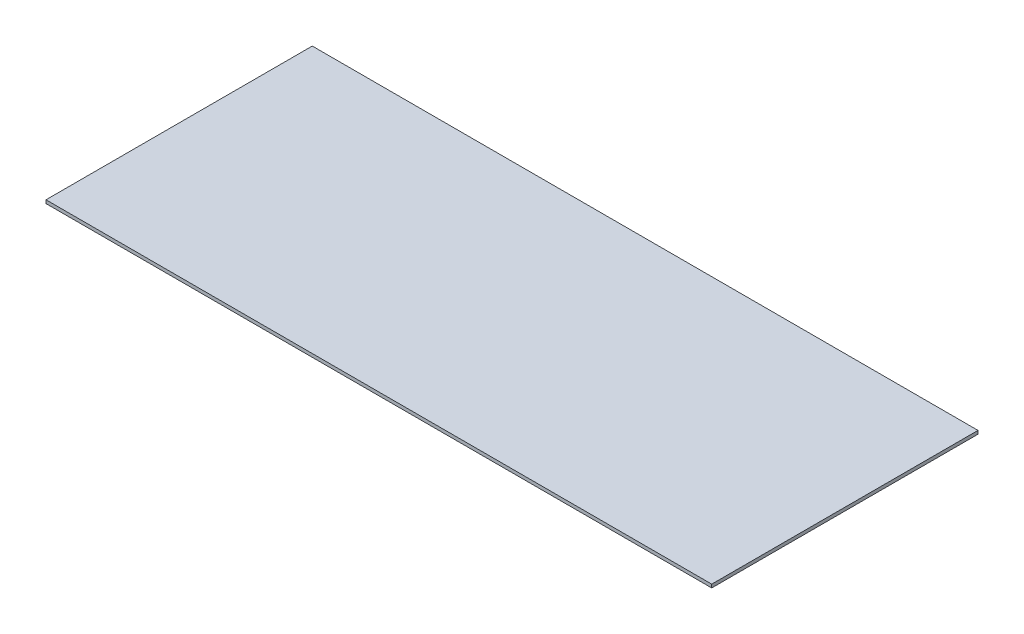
ISO-10303-21;
HEADER;
FILE_DESCRIPTION(('STEP AP214'),'2;1');
FILE_NAME('part.step','',(''),(''),'','','');
FILE_SCHEMA(('AUTOMOTIVE_DESIGN { 1 0 10303 214 1 1 1 1 }'));
ENDSEC;
DATA;
#1=APPLICATION_CONTEXT('core data for automotive mechanical design processes');
#2=APPLICATION_PROTOCOL_DEFINITION('international standard','automotive_design',2000,#1);
#3=PRODUCT_CONTEXT('',#1,'mechanical');
#4=PRODUCT('Part','Part','',(#3));
#5=PRODUCT_RELATED_PRODUCT_CATEGORY('part','',(#4));
#6=PRODUCT_DEFINITION_FORMATION('','',#4);
#7=PRODUCT_DEFINITION_CONTEXT('part definition',#1,'design');
#8=PRODUCT_DEFINITION('design','',#6,#7);
#9=PRODUCT_DEFINITION_SHAPE('','',#8);
#10=(LENGTH_UNIT() NAMED_UNIT(*) SI_UNIT(.MILLI.,.METRE.));
#11=(NAMED_UNIT(*) PLANE_ANGLE_UNIT() SI_UNIT($,.RADIAN.));
#12=(NAMED_UNIT(*) SI_UNIT($,.STERADIAN.) SOLID_ANGLE_UNIT());
#13=UNCERTAINTY_MEASURE_WITH_UNIT(LENGTH_MEASURE(1.E-05),#10,'distance_accuracy_value','');
#14=(GEOMETRIC_REPRESENTATION_CONTEXT(3) GLOBAL_UNCERTAINTY_ASSIGNED_CONTEXT((#13)) GLOBAL_UNIT_ASSIGNED_CONTEXT((#10,
#11,#12)) REPRESENTATION_CONTEXT('',''));
#15=CARTESIAN_POINT('',(0.,0.,0.));
#16=DIRECTION('',(0.,0.,1.));
#17=DIRECTION('',(1.,0.,0.));
#18=AXIS2_PLACEMENT_3D('',#15,#16,#17);
#19=CARTESIAN_POINT('',(0.,0.,800.));
#20=DIRECTION('',(-1.,0.,0.));
#21=DIRECTION('',(0.,0.,1.));
#22=AXIS2_PLACEMENT_3D('',#19,#20,#21);
#23=PLANE('',#22);
#24=DIRECTION('',(0.,1.,0.));
#25=VECTOR('',#24,1.);
#26=CARTESIAN_POINT('',(0.,0.,0.));
#27=LINE('',#26,#25);
#28=CARTESIAN_POINT('',(0.,0.,0.));
#29=VERTEX_POINT('',#28);
#30=CARTESIAN_POINT('',(0.,10.,0.));
#31=VERTEX_POINT('',#30);
#32=EDGE_CURVE('E75',#29,#31,#27,.T.);
#33=ORIENTED_EDGE('',*,*,#32,.T.);
#34=DIRECTION('',(0.,0.,-1.));
#35=VECTOR('',#34,1.);
#36=CARTESIAN_POINT('',(0.,10.,800.));
#37=LINE('',#36,#35);
#38=CARTESIAN_POINT('',(0.,10.,800.));
#39=VERTEX_POINT('',#38);
#40=EDGE_CURVE('E11',#39,#31,#37,.T.);
#41=ORIENTED_EDGE('',*,*,#40,.F.);
#42=DIRECTION('',(0.,1.,0.));
#43=VECTOR('',#42,1.);
#44=CARTESIAN_POINT('',(0.,0.,800.));
#45=LINE('',#44,#43);
#46=CARTESIAN_POINT('',(0.,0.,800.));
#47=VERTEX_POINT('',#46);
#48=EDGE_CURVE('E93',#47,#39,#45,.T.);
#49=ORIENTED_EDGE('',*,*,#48,.F.);
#50=DIRECTION('',(0.,0.,-1.));
#51=VECTOR('',#50,1.);
#52=CARTESIAN_POINT('',(0.,0.,800.));
#53=LINE('',#52,#51);
#54=EDGE_CURVE('E87',#47,#29,#53,.T.);
#55=ORIENTED_EDGE('',*,*,#54,.T.);
#56=EDGE_LOOP('',(#33,#41,#49,#55));
#57=FACE_BOUND('',#56,.T.);
#58=ADVANCED_FACE('F31',(#57),#23,.F.);
#59=CARTESIAN_POINT('',(0.,10.,800.));
#60=DIRECTION('',(0.,-1.,0.));
#61=DIRECTION('',(1.,0.,0.));
#62=AXIS2_PLACEMENT_3D('',#59,#60,#61);
#63=PLANE('',#62);
#64=DIRECTION('',(-1.,0.,0.));
#65=VECTOR('',#64,1.);
#66=CARTESIAN_POINT('',(0.,10.,0.));
#67=LINE('',#66,#65);
#68=CARTESIAN_POINT('',(-2000.,10.,0.));
#69=VERTEX_POINT('',#68);
#70=EDGE_CURVE('E71',#31,#69,#67,.T.);
#71=ORIENTED_EDGE('',*,*,#70,.T.);
#72=DIRECTION('',(0.,0.,-1.));
#73=VECTOR('',#72,1.);
#74=CARTESIAN_POINT('',(-2000.,10.,800.));
#75=LINE('',#74,#73);
#76=CARTESIAN_POINT('',(-2000.,10.,800.));
#77=VERTEX_POINT('',#76);
#78=EDGE_CURVE('E38',#77,#69,#75,.T.);
#79=ORIENTED_EDGE('',*,*,#78,.F.);
#80=DIRECTION('',(-1.,0.,0.));
#81=VECTOR('',#80,1.);
#82=CARTESIAN_POINT('',(0.,10.,800.));
#83=LINE('',#82,#81);
#84=EDGE_CURVE('E83',#39,#77,#83,.T.);
#85=ORIENTED_EDGE('',*,*,#84,.F.);
#86=ORIENTED_EDGE('',*,*,#40,.T.);
#87=EDGE_LOOP('',(#71,#79,#85,#86));
#88=FACE_BOUND('',#87,.T.);
#89=ADVANCED_FACE('F82',(#88),#63,.F.);
#90=CARTESIAN_POINT('',(-2000.,0.,800.));
#91=DIRECTION('',(1.,0.,0.));
#92=DIRECTION('',(0.,0.,-1.));
#93=AXIS2_PLACEMENT_3D('',#90,#91,#92);
#94=PLANE('',#93);
#95=DIRECTION('',(0.,-1.,0.));
#96=VECTOR('',#95,1.);
#97=CARTESIAN_POINT('',(-2000.,0.,0.));
#98=LINE('',#97,#96);
#99=CARTESIAN_POINT('',(-2000.,0.,0.));
#100=VERTEX_POINT('',#99);
#101=EDGE_CURVE('E76',#69,#100,#98,.T.);
#102=ORIENTED_EDGE('',*,*,#101,.T.);
#103=DIRECTION('',(0.,0.,-1.));
#104=VECTOR('',#103,1.);
#105=CARTESIAN_POINT('',(-2000.,0.,800.));
#106=LINE('',#105,#104);
#107=CARTESIAN_POINT('',(-2000.,0.,800.));
#108=VERTEX_POINT('',#107);
#109=EDGE_CURVE('E99',#108,#100,#106,.T.);
#110=ORIENTED_EDGE('',*,*,#109,.F.);
#111=DIRECTION('',(0.,-1.,0.));
#112=VECTOR('',#111,1.);
#113=CARTESIAN_POINT('',(-2000.,0.,800.));
#114=LINE('',#113,#112);
#115=EDGE_CURVE('E50',#77,#108,#114,.T.);
#116=ORIENTED_EDGE('',*,*,#115,.F.);
#117=ORIENTED_EDGE('',*,*,#78,.T.);
#118=EDGE_LOOP('',(#102,#110,#116,#117));
#119=FACE_BOUND('',#118,.T.);
#120=ADVANCED_FACE('F102',(#119),#94,.F.);
#121=CARTESIAN_POINT('',(0.,0.,800.));
#122=DIRECTION('',(0.,1.,0.));
#123=DIRECTION('',(-1.,0.,0.));
#124=AXIS2_PLACEMENT_3D('',#121,#122,#123);
#125=PLANE('',#124);
#126=DIRECTION('',(1.,0.,0.));
#127=VECTOR('',#126,1.);
#128=CARTESIAN_POINT('',(0.,0.,0.));
#129=LINE('',#128,#127);
#130=EDGE_CURVE('E91',#100,#29,#129,.T.);
#131=ORIENTED_EDGE('',*,*,#130,.T.);
#132=ORIENTED_EDGE('',*,*,#54,.F.);
#133=DIRECTION('',(1.,0.,0.));
#134=VECTOR('',#133,1.);
#135=CARTESIAN_POINT('',(0.,0.,800.));
#136=LINE('',#135,#134);
#137=EDGE_CURVE('E45',#108,#47,#136,.T.);
#138=ORIENTED_EDGE('',*,*,#137,.F.);
#139=ORIENTED_EDGE('',*,*,#109,.T.);
#140=EDGE_LOOP('',(#131,#132,#138,#139));
#141=FACE_BOUND('',#140,.T.);
#142=ADVANCED_FACE('F104',(#141),#125,.F.);
#143=CARTESIAN_POINT('',(0.,10.,800.));
#144=DIRECTION('',(0.,0.,1.));
#145=DIRECTION('',(1.,0.,0.));
#146=AXIS2_PLACEMENT_3D('',#143,#144,#145);
#147=PLANE('',#146);
#148=ORIENTED_EDGE('',*,*,#48,.T.);
#149=ORIENTED_EDGE('',*,*,#84,.T.);
#150=ORIENTED_EDGE('',*,*,#115,.T.);
#151=ORIENTED_EDGE('',*,*,#137,.T.);
#152=EDGE_LOOP('',(#148,#149,#150,#151));
#153=FACE_BOUND('',#152,.T.);
#154=ADVANCED_FACE('F105',(#153),#147,.T.);
#155=CARTESIAN_POINT('',(0.,10.,0.));
#156=DIRECTION('',(0.,0.,1.));
#157=DIRECTION('',(1.,0.,0.));
#158=AXIS2_PLACEMENT_3D('',#155,#156,#157);
#159=PLANE('',#158);
#160=ORIENTED_EDGE('',*,*,#32,.F.);
#161=ORIENTED_EDGE('',*,*,#130,.F.);
#162=ORIENTED_EDGE('',*,*,#101,.F.);
#163=ORIENTED_EDGE('',*,*,#70,.F.);
#164=EDGE_LOOP('',(#160,#161,#162,#163));
#165=FACE_BOUND('',#164,.T.);
#166=ADVANCED_FACE('F72',(#165),#159,.F.);
#167=CLOSED_SHELL('',(#58,#89,#120,#142,#154,#166));
#168=MANIFOLD_SOLID_BREP('B2',#167);
#169=ADVANCED_BREP_SHAPE_REPRESENTATION('',(#18,#168),#14);
#170=SHAPE_DEFINITION_REPRESENTATION(#9,#169);
ENDSEC;
END-ISO-10303-21;
